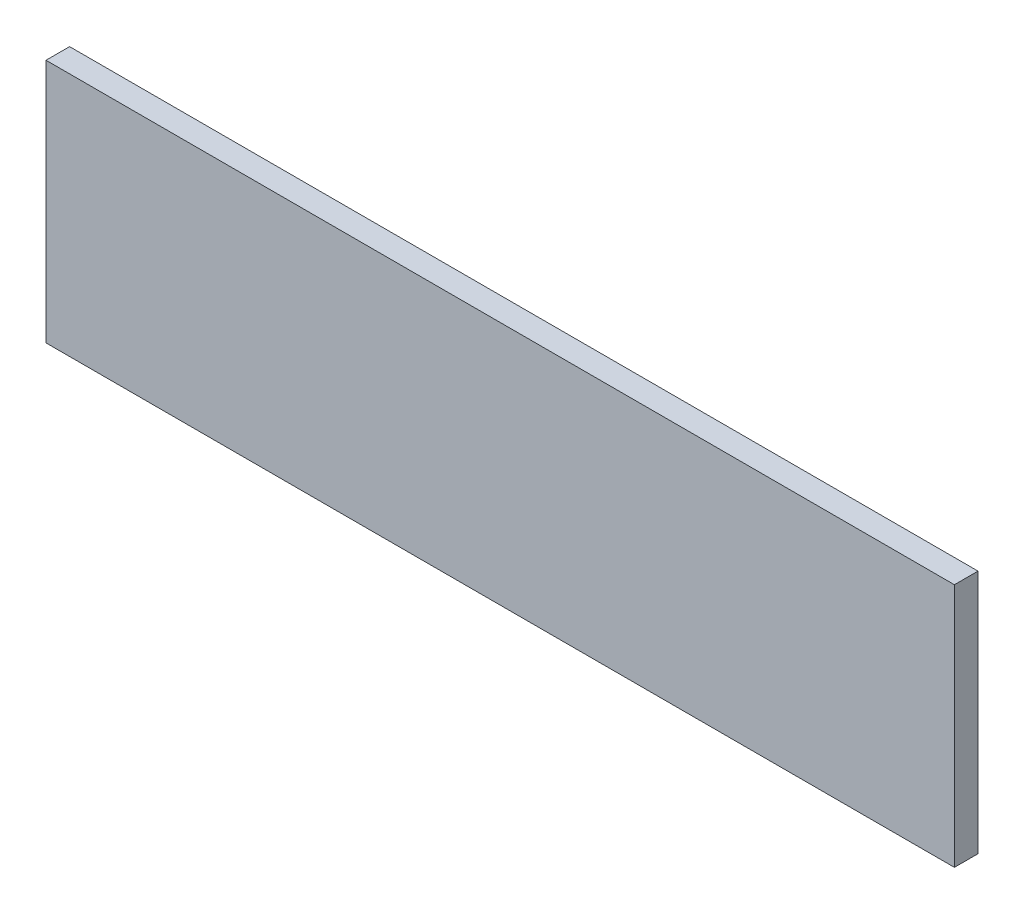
from build123d import *

# Parameters (mm, degrees)
ESQUISSE1_W      = 308
ESQUISSE1_H      = 83
EXTRUSION1_DEPTH = 8


with BuildPart() as part:
    # Esquisse1 → Extrusion1 (new body)
    with BuildSketch(Plane.XY):
        with Locations((154, 41.5)):
            Rectangle(ESQUISSE1_W, ESQUISSE1_H)
    extrude(amount=-EXTRUSION1_DEPTH)


solid = part.part
